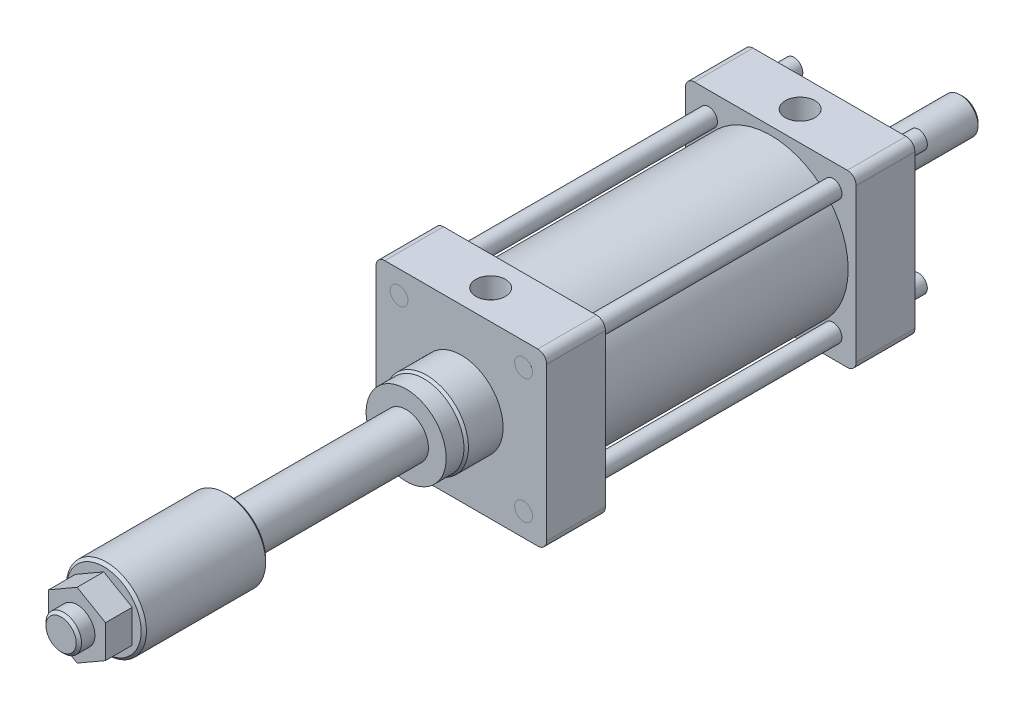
from build123d import *

# Parameters (mm, degrees)
SKETCH_1_R              = 5
EXTRUDE_1_DEPTH         = 33
SKETCH_2_R              = 23.5
EXTRUDE_2_DEPTH         = 21
SKETCH_3_R              = 12.5
EXTRUDE_3_DEPTH         = 14
SKETCH_4_R              = 10
EXTRUDE_4_DEPTH         = 40
CHAMFER_1_SIZE          = 1.5
SKETCH_5_R              = 43.5
EXTRUDE_5_DEPTH         = 141
SKETCH_6_R              = 5
EXTRUDE_6_DEPTH         = 33
EXTRUDE_START           = 21
SKETCH_7_R              = 23.5
EXTRUDE_7_DEPTH         = 21
CHAMFER_2_SIZE          = 1.5
SKETCH_8_R              = 22.5
EXTRUDE_8_DEPTH         = 10
EXTRUDE_START_2         = 100
SKETCH_9_R              = 12.5
EXTRUDE_10_DEPTH        = 100
SKETCH_10_R             = 22.5
EXTRUDE_11_DEPTH        = 70
EXTRUDE_12_DEPTH        = 15
EXTRUDE_START_3         = 9
SKETCH_12_R             = 10
EXTRUDE_13_DEPTH        = 9
CHAMFER_3_SIZE          = 1.5
EXTRUDE_14_DEPTH        = 15
EXTRUDE_14_DEPTH_BACK   = 207
SKETCH_13_R             = 5
EXTRUDE_14_2_DEPTH      = 15
EXTRUDE_14_2_DEPTH_BACK = 207
EXTRUDE_14_3_DEPTH      = 15
EXTRUDE_14_3_DEPTH_BACK = 207
EXTRUDE_14_4_DEPTH      = 15
EXTRUDE_14_4_DEPTH_BACK = 207
F_3_8_RC_1_AT_2_COUNT   = 2
F_3_8_RC_1_AT_2_PITCH   = 174


with BuildPart() as part:
    # Sketch 1 → Extrude 1 (new body)
    with BuildSketch(Plane.XY):
        with BuildLine():
            Line((43, 48), (-43, 48))
            ThreePointArc((-43, 48), (-46.535533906, 46.535533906), (-48, 43))
            Line((-48, 43), (-48, -43))
            ThreePointArc((-48, -43), (-46.535533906, -46.535533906), (-43, -48))
            Line((-43, -48), (43, -48))
            ThreePointArc((43, -48), (46.535533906, -46.535533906), (48, -43))
            Line((48, -43), (48, 43))
            ThreePointArc((48, 43), (46.535533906, 46.535533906), (43, 48))
        make_face()
        with Locations((35, -35)):
            Circle(SKETCH_1_R, mode=Mode.SUBTRACT)
        with Locations((-35, -35)):
            Circle(SKETCH_1_R, mode=Mode.SUBTRACT)
        with Locations((-35, 35)):
            Circle(SKETCH_1_R, mode=Mode.SUBTRACT)
        with Locations((35, 35)):
            Circle(SKETCH_1_R, mode=Mode.SUBTRACT)
    extrude(amount=EXTRUDE_1_DEPTH)

    # Sketch 2 → Extrude 2 (add)
    with BuildSketch(Plane(origin=(0, 0, 0), x_dir=(-1, 0, 0), z_dir=(0, 0, -1))):
        with Locations(Location((0, 0, 0), (0, 0, 180))):
            Circle(SKETCH_2_R)
    extrude(amount=EXTRUDE_2_DEPTH)

    # Sketch 3 → Extrude 3 (add)
    with BuildSketch(Plane(origin=(0, 0, -21), x_dir=(-1, 0, 0), z_dir=(0, 0, -1))):
        Circle(SKETCH_3_R)
    extrude(amount=EXTRUDE_3_DEPTH)

    # Sketch 4 → Extrude 4 (add)
    with BuildSketch(Plane(origin=(0, 0, -35), x_dir=(-1, 0, 0), z_dir=(0, 0, -1))):
        Circle(SKETCH_4_R)
    extrude(amount=EXTRUDE_4_DEPTH)

    # Chamfer 1
    chamfer_1_edges = [part.edges().sort_by_distance(p)[0] for p in [
        (-23.5, 0, -21),
        (12.5, 0, -35),
        (10, 0, -75),
    ]]
    chamfer(chamfer_1_edges, length=CHAMFER_1_SIZE)

    # Sketch 5 → Extrude 5 (add)
    with BuildSketch(Plane.XY.offset(33)):
        Circle(SKETCH_5_R)
    extrude(amount=EXTRUDE_5_DEPTH)

    # Sketch 6 → Extrude 6 (add)
    with BuildSketch(Plane.XY.offset(174)):
        with BuildLine():
            Line((-48, 43), (-48, -43))
            ThreePointArc((-48, -43), (-46.535533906, -46.535533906), (-43, -48))
            Line((-43, -48), (43, -48))
            ThreePointArc((43, -48), (46.535533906, -46.535533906), (48, -43))
            Line((48, -43), (48, 43))
            ThreePointArc((48, 43), (46.535533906, 46.535533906), (43, 48))
            Line((43, 48), (-43, 48))
            ThreePointArc((-43, 48), (-46.535533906, 46.535533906), (-48, 43))
        make_face()
        with Locations((35, 35)):
            Circle(SKETCH_6_R, mode=Mode.SUBTRACT)
        with Locations((35, -35)):
            Circle(SKETCH_6_R, mode=Mode.SUBTRACT)
        with Locations((-35, 35)):
            Circle(SKETCH_6_R, mode=Mode.SUBTRACT)
        with Locations((-35, -35)):
            Circle(SKETCH_6_R, mode=Mode.SUBTRACT)
    extrude(amount=EXTRUDE_6_DEPTH)

    # Sketch 7 → Extrude 7 (add)
    with BuildSketch(Plane.XY.offset(207).offset(EXTRUDE_START)):
        Circle(SKETCH_7_R)
    extrude(amount=-EXTRUDE_7_DEPTH)

    # Chamfer 2
    chamfer_2_edges = [part.edges().sort_by_distance(p)[0] for p in [
        (-23.5, 0, 228),
    ]]
    chamfer(chamfer_2_edges, length=CHAMFER_2_SIZE)

    # Sketch 8 → Extrude 8 (add)
    with BuildSketch(Plane.XY.offset(228)):
        Circle(SKETCH_8_R)
    extrude(amount=EXTRUDE_8_DEPTH)

    # Sketch 9 → Extrude 10 (add)
    with BuildSketch(Plane.XY.offset(238).offset(EXTRUDE_START_2)):
        Circle(SKETCH_9_R)
    extrude(amount=-EXTRUDE_10_DEPTH)

    # Sketch 10 → Extrude 11 (add)
    with BuildSketch(Plane.XY.offset(338)):
        Circle(SKETCH_10_R)
    extrude(amount=EXTRUDE_11_DEPTH)

    # Sketch 11 → Extrude 12 (add)
    with BuildSketch(Plane.XY.offset(408)):
        Polygon((0, 18.475208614), (-16, 9.237604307), (-16, -9.237604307), (0, -18.475208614), (16, -9.237604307), (16, 9.237604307), align=None)
    extrude(amount=EXTRUDE_12_DEPTH)

    # Sketch 12 → Extrude 13 (add)
    with BuildSketch(Plane.XY.offset(423).offset(EXTRUDE_START_3)):
        with Locations(Location((0, 0, 0), (0, 0, 180))):
            Circle(SKETCH_12_R)
    extrude(amount=-EXTRUDE_13_DEPTH)

    # Chamfer 3
    chamfer_3_edges = [part.edges().sort_by_distance(p)[0] for p in [
        (-22.5, 0, 338),
        (-22.5, 0, 408),
        (10, 0, 432),
    ]]
    chamfer(chamfer_3_edges, length=CHAMFER_3_SIZE)

    # Sketch 15 → 3_8 Rc _1 (revolve, cut)
    with BuildSketch(Plane(origin=(0, 48, 16.5), x_dir=(0, 0, 1), z_dir=(1, 0, 0))):
        Polygon((0, 0), (0, 22.386153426), (7.15, 18.09), (7.15, 11.4), (7.97513052, 11.4), (8.331, 0), align=None)
    f_3_8_rc_1 = revolve(axis=Axis((0, 54.35, 16.5), (0, -1, 0)), mode=Mode.SUBTRACT)

    # 3_8 Rc _1 at 2: 3_8 Rc _1 ×2
    with Locations(*[(0, 0, i * F_3_8_RC_1_AT_2_PITCH) for i in range(1, F_3_8_RC_1_AT_2_COUNT)]):
        add(f_3_8_rc_1, mode=Mode.SUBTRACT)


with BuildPart() as body_2:
    # Sketch 13 → Extrude 14 (new, two sides: drawn at the far end of the back side and taken through both)
    with BuildSketch(Plane(origin=(0, 0, 0), x_dir=(-1, 0, 0), z_dir=(0, 0, -1)).offset(-EXTRUDE_14_DEPTH_BACK)):
        with Locations((-35, -35)):
            Circle(SKETCH_13_R)
    extrude(amount=EXTRUDE_14_DEPTH + EXTRUDE_14_DEPTH_BACK)


with BuildPart() as body_3:
    # Sketch 13 → Extrude 14 2 (new, two sides: drawn at the far end of the back side and taken through both)
    with BuildSketch(Plane(origin=(0, 0, 0), x_dir=(-1, 0, 0), z_dir=(0, 0, -1)).offset(-EXTRUDE_14_2_DEPTH_BACK)):
        with Locations((35, -35)):
            Circle(SKETCH_13_R)
    extrude(amount=EXTRUDE_14_2_DEPTH + EXTRUDE_14_2_DEPTH_BACK)


with BuildPart() as body_4:
    # Sketch 13 → Extrude 14 3 (new, two sides: drawn at the far end of the back side and taken through both)
    with BuildSketch(Plane(origin=(0, 0, 0), x_dir=(-1, 0, 0), z_dir=(0, 0, -1)).offset(-EXTRUDE_14_3_DEPTH_BACK)):
        with Locations((35, 35)):
            Circle(SKETCH_13_R)
    extrude(amount=EXTRUDE_14_3_DEPTH + EXTRUDE_14_3_DEPTH_BACK)


with BuildPart() as body_5:
    # Sketch 13 → Extrude 14 4 (new, two sides: drawn at the far end of the back side and taken through both)
    with BuildSketch(Plane(origin=(0, 0, 0), x_dir=(-1, 0, 0), z_dir=(0, 0, -1)).offset(-EXTRUDE_14_4_DEPTH_BACK)):
        with Locations((-35, 35)):
            Circle(SKETCH_13_R)
    extrude(amount=EXTRUDE_14_4_DEPTH + EXTRUDE_14_4_DEPTH_BACK)


solid = Compound([part.part, body_2.part, body_3.part, body_4.part, body_5.part])
